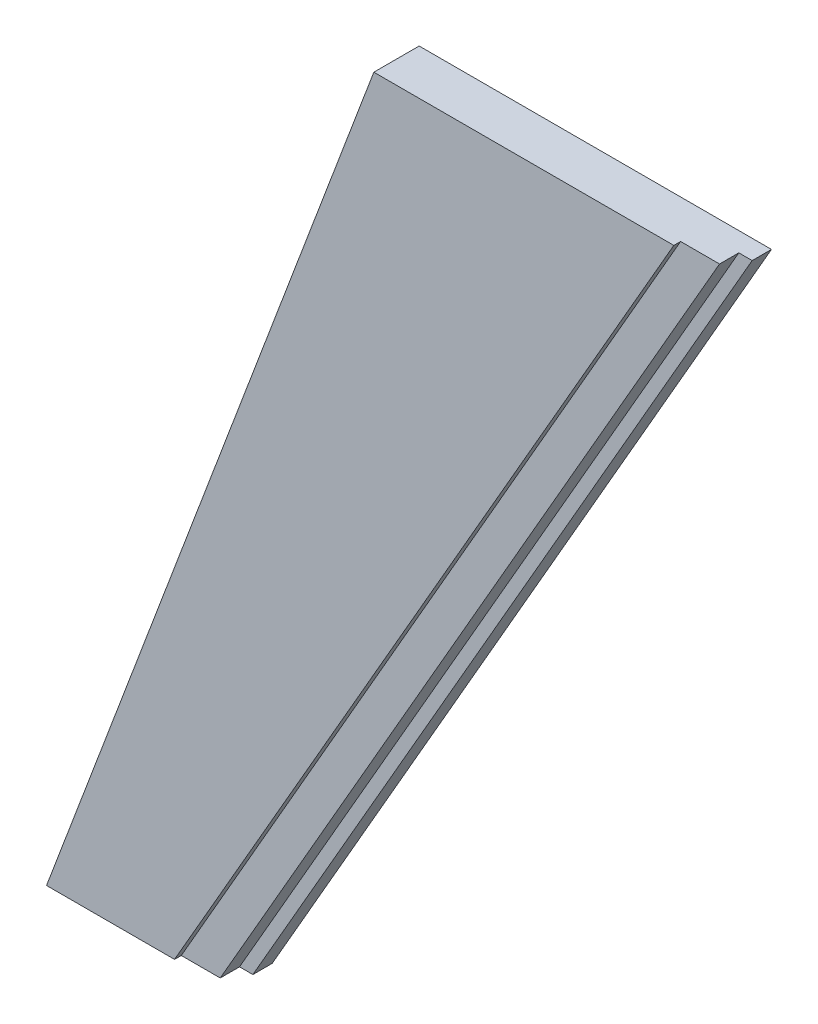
ISO-10303-21;
HEADER;
FILE_DESCRIPTION(('STEP AP214'),'2;1');
FILE_NAME('part.step','',(''),(''),'','','');
FILE_SCHEMA(('AUTOMOTIVE_DESIGN { 1 0 10303 214 1 1 1 1 }'));
ENDSEC;
DATA;
#1=APPLICATION_CONTEXT('core data for automotive mechanical design processes');
#2=APPLICATION_PROTOCOL_DEFINITION('international standard','automotive_design',2000,#1);
#3=PRODUCT_CONTEXT('',#1,'mechanical');
#4=PRODUCT('Part','Part','',(#3));
#5=PRODUCT_RELATED_PRODUCT_CATEGORY('part','',(#4));
#6=PRODUCT_DEFINITION_FORMATION('','',#4);
#7=PRODUCT_DEFINITION_CONTEXT('part definition',#1,'design');
#8=PRODUCT_DEFINITION('design','',#6,#7);
#9=PRODUCT_DEFINITION_SHAPE('','',#8);
#10=(LENGTH_UNIT() NAMED_UNIT(*) SI_UNIT(.MILLI.,.METRE.));
#11=(NAMED_UNIT(*) PLANE_ANGLE_UNIT() SI_UNIT($,.RADIAN.));
#12=(NAMED_UNIT(*) SI_UNIT($,.STERADIAN.) SOLID_ANGLE_UNIT());
#13=UNCERTAINTY_MEASURE_WITH_UNIT(LENGTH_MEASURE(1.E-05),#10,'distance_accuracy_value','');
#14=(GEOMETRIC_REPRESENTATION_CONTEXT(3) GLOBAL_UNCERTAINTY_ASSIGNED_CONTEXT((#13)) GLOBAL_UNIT_ASSIGNED_CONTEXT((#10,
#11,#12)) REPRESENTATION_CONTEXT('',''));
#15=CARTESIAN_POINT('',(0.,0.,0.));
#16=DIRECTION('',(0.,0.,1.));
#17=DIRECTION('',(1.,0.,0.));
#18=AXIS2_PLACEMENT_3D('',#15,#16,#17);
#19=CARTESIAN_POINT('',(-620.780305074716,0.,47.));
#20=DIRECTION('',(-0.866820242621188,0.498620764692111,0.));
#21=DIRECTION('',(-0.498620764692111,-0.866820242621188,0.));
#22=AXIS2_PLACEMENT_3D('',#19,#20,#21);
#23=PLANE('',#22);
#24=DIRECTION('',(0.,0.,-1.));
#25=VECTOR('',#24,1.);
#26=CARTESIAN_POINT('',(-1138.48705228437,-900.000000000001,47.));
#27=LINE('',#26,#25);
#28=CARTESIAN_POINT('',(-1138.48705228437,-900.000000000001,47.));
#29=VERTEX_POINT('',#28);
#30=CARTESIAN_POINT('',(-1138.48705228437,-900.000000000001,40.));
#31=VERTEX_POINT('',#30);
#32=EDGE_CURVE('E49',#29,#31,#27,.T.);
#33=ORIENTED_EDGE('',*,*,#32,.T.);
#34=DIRECTION('',(0.498620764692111,0.866820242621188,0.));
#35=VECTOR('',#34,1.);
#36=CARTESIAN_POINT('',(-620.780305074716,0.,40.));
#37=LINE('',#36,#35);
#38=CARTESIAN_POINT('',(-620.780305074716,0.,40.));
#39=VERTEX_POINT('',#38);
#40=EDGE_CURVE('E45',#31,#39,#37,.T.);
#41=ORIENTED_EDGE('',*,*,#40,.T.);
#42=DIRECTION('',(0.,0.,-1.));
#43=VECTOR('',#42,1.);
#44=CARTESIAN_POINT('',(-620.780305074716,0.,47.));
#45=LINE('',#44,#43);
#46=CARTESIAN_POINT('',(-620.780305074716,0.,47.));
#47=VERTEX_POINT('',#46);
#48=EDGE_CURVE('E11',#47,#39,#45,.T.);
#49=ORIENTED_EDGE('',*,*,#48,.F.);
#50=DIRECTION('',(0.498620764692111,0.866820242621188,0.));
#51=VECTOR('',#50,1.);
#52=CARTESIAN_POINT('',(-620.780305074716,0.,47.));
#53=LINE('',#52,#51);
#54=EDGE_CURVE('E147',#29,#47,#53,.T.);
#55=ORIENTED_EDGE('',*,*,#54,.F.);
#56=EDGE_LOOP('',(#33,#41,#49,#55));
#57=FACE_BOUND('',#56,.T.);
#58=ADVANCED_FACE('F31',(#57),#23,.F.);
#59=CARTESIAN_POINT('',(-620.780305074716,0.,47.));
#60=DIRECTION('',(0.,-1.,0.));
#61=DIRECTION('',(1.,0.,0.));
#62=AXIS2_PLACEMENT_3D('',#59,#60,#61);
#63=PLANE('',#62);
#64=DIRECTION('',(-1.,0.,0.));
#65=VECTOR('',#64,1.);
#66=CARTESIAN_POINT('',(-620.780305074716,0.,0.));
#67=LINE('',#66,#65);
#68=CARTESIAN_POINT('',(-566.559143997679,0.,0.));
#69=VERTEX_POINT('',#68);
#70=CARTESIAN_POINT('',(-931.84683607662,-1.14114555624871E-13,0.));
#71=VERTEX_POINT('',#70);
#72=EDGE_CURVE('E94',#69,#71,#67,.T.);
#73=ORIENTED_EDGE('',*,*,#72,.T.);
#74=DIRECTION('',(0.,0.,-1.));
#75=VECTOR('',#74,1.);
#76=CARTESIAN_POINT('',(-931.84683607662,-1.14114555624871E-13,47.));
#77=LINE('',#76,#75);
#78=CARTESIAN_POINT('',(-931.84683607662,-1.14114555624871E-13,47.));
#79=VERTEX_POINT('',#78);
#80=EDGE_CURVE('E38',#79,#71,#77,.T.);
#81=ORIENTED_EDGE('',*,*,#80,.F.);
#82=DIRECTION('',(-1.,0.,0.));
#83=VECTOR('',#82,1.);
#84=CARTESIAN_POINT('',(-620.780305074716,0.,47.));
#85=LINE('',#84,#83);
#86=EDGE_CURVE('E150',#47,#79,#85,.T.);
#87=ORIENTED_EDGE('',*,*,#86,.F.);
#88=ORIENTED_EDGE('',*,*,#48,.T.);
#89=DIRECTION('',(1.,0.,0.));
#90=VECTOR('',#89,1.);
#91=CARTESIAN_POINT('',(-620.780305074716,0.,40.));
#92=LINE('',#91,#90);
#93=CARTESIAN_POINT('',(-580.402844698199,0.,40.));
#94=VERTEX_POINT('',#93);
#95=EDGE_CURVE('E131',#39,#94,#92,.T.);
#96=ORIENTED_EDGE('',*,*,#95,.T.);
#97=DIRECTION('',(0.,0.,-1.));
#98=VECTOR('',#97,1.);
#99=CARTESIAN_POINT('',(-580.402844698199,0.,40.));
#100=LINE('',#99,#98);
#101=CARTESIAN_POINT('',(-580.402844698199,0.,20.));
#102=VERTEX_POINT('',#101);
#103=EDGE_CURVE('E140',#94,#102,#100,.T.);
#104=ORIENTED_EDGE('',*,*,#103,.T.);
#105=DIRECTION('',(1.,0.,0.));
#106=VECTOR('',#105,1.);
#107=CARTESIAN_POINT('',(-580.402844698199,0.,20.));
#108=LINE('',#107,#106);
#109=CARTESIAN_POINT('',(-566.559143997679,0.,20.));
#110=VERTEX_POINT('',#109);
#111=EDGE_CURVE('E110',#102,#110,#108,.T.);
#112=ORIENTED_EDGE('',*,*,#111,.T.);
#113=DIRECTION('',(0.,0.,-1.));
#114=VECTOR('',#113,1.);
#115=CARTESIAN_POINT('',(-566.559143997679,0.,20.));
#116=LINE('',#115,#114);
#117=EDGE_CURVE('E107',#110,#69,#116,.T.);
#118=ORIENTED_EDGE('',*,*,#117,.T.);
#119=EDGE_LOOP('',(#73,#81,#87,#88,#96,#104,#112,#118));
#120=FACE_BOUND('',#119,.T.);
#121=ADVANCED_FACE('F108',(#120),#63,.F.);
#122=CARTESIAN_POINT('',(-931.84683607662,-1.14114555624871E-13,47.));
#123=DIRECTION('',(0.935690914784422,-0.352820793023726,0.));
#124=DIRECTION('',(0.352820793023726,0.935690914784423,0.));
#125=AXIS2_PLACEMENT_3D('',#122,#123,#124);
#126=PLANE('',#125);
#127=DIRECTION('',(-0.352820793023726,-0.935690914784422,0.));
#128=VECTOR('',#127,1.);
#129=CARTESIAN_POINT('',(-931.84683607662,-1.14114555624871E-13,0.));
#130=LINE('',#129,#128);
#131=CARTESIAN_POINT('',(-1271.20966273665,-900.,0.));
#132=VERTEX_POINT('',#131);
#133=EDGE_CURVE('E100',#71,#132,#130,.T.);
#134=ORIENTED_EDGE('',*,*,#133,.T.);
#135=DIRECTION('',(0.,0.,-1.));
#136=VECTOR('',#135,1.);
#137=CARTESIAN_POINT('',(-1271.20966273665,-900.,47.));
#138=LINE('',#137,#136);
#139=CARTESIAN_POINT('',(-1271.20966273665,-900.,47.));
#140=VERTEX_POINT('',#139);
#141=EDGE_CURVE('E157',#140,#132,#138,.T.);
#142=ORIENTED_EDGE('',*,*,#141,.F.);
#143=DIRECTION('',(-0.352820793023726,-0.935690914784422,0.));
#144=VECTOR('',#143,1.);
#145=CARTESIAN_POINT('',(-931.84683607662,-1.14114555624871E-13,47.));
#146=LINE('',#145,#144);
#147=EDGE_CURVE('E152',#79,#140,#146,.T.);
#148=ORIENTED_EDGE('',*,*,#147,.F.);
#149=ORIENTED_EDGE('',*,*,#80,.T.);
#150=EDGE_LOOP('',(#134,#142,#148,#149));
#151=FACE_BOUND('',#150,.T.);
#152=ADVANCED_FACE('F161',(#151),#126,.F.);
#153=CARTESIAN_POINT('',(-1271.20966273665,-900.,47.));
#154=DIRECTION('',(0.,1.,0.));
#155=DIRECTION('',(-1.,0.,0.));
#156=AXIS2_PLACEMENT_3D('',#153,#154,#155);
#157=PLANE('',#156);
#158=DIRECTION('',(1.,0.,0.));
#159=VECTOR('',#158,1.);
#160=CARTESIAN_POINT('',(-1271.20966273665,-900.,0.));
#161=LINE('',#160,#159);
#162=CARTESIAN_POINT('',(-1084.26589120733,-900.000000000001,0.));
#163=VERTEX_POINT('',#162);
#164=EDGE_CURVE('E145',#132,#163,#161,.T.);
#165=ORIENTED_EDGE('',*,*,#164,.T.);
#166=DIRECTION('',(0.,0.,-1.));
#167=VECTOR('',#166,1.);
#168=CARTESIAN_POINT('',(-1084.26589120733,-900.000000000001,20.));
#169=LINE('',#168,#167);
#170=CARTESIAN_POINT('',(-1084.26589120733,-900.000000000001,20.));
#171=VERTEX_POINT('',#170);
#172=EDGE_CURVE('E114',#171,#163,#169,.T.);
#173=ORIENTED_EDGE('',*,*,#172,.F.);
#174=DIRECTION('',(-1.,0.,0.));
#175=VECTOR('',#174,1.);
#176=CARTESIAN_POINT('',(-1098.10959190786,-900.000000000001,20.));
#177=LINE('',#176,#175);
#178=CARTESIAN_POINT('',(-1098.10959190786,-900.000000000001,20.));
#179=VERTEX_POINT('',#178);
#180=EDGE_CURVE('E115',#171,#179,#177,.T.);
#181=ORIENTED_EDGE('',*,*,#180,.T.);
#182=DIRECTION('',(0.,0.,-1.));
#183=VECTOR('',#182,1.);
#184=CARTESIAN_POINT('',(-1098.10959190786,-900.000000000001,40.));
#185=LINE('',#184,#183);
#186=CARTESIAN_POINT('',(-1098.10959190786,-900.000000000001,40.));
#187=VERTEX_POINT('',#186);
#188=EDGE_CURVE('E104',#187,#179,#185,.T.);
#189=ORIENTED_EDGE('',*,*,#188,.F.);
#190=DIRECTION('',(-1.,0.,0.));
#191=VECTOR('',#190,1.);
#192=CARTESIAN_POINT('',(-1138.48705228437,-900.000000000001,40.));
#193=LINE('',#192,#191);
#194=EDGE_CURVE('E137',#187,#31,#193,.T.);
#195=ORIENTED_EDGE('',*,*,#194,.T.);
#196=ORIENTED_EDGE('',*,*,#32,.F.);
#197=DIRECTION('',(1.,0.,0.));
#198=VECTOR('',#197,1.);
#199=CARTESIAN_POINT('',(-1271.20966273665,-900.,47.));
#200=LINE('',#199,#198);
#201=EDGE_CURVE('E154',#140,#29,#200,.T.);
#202=ORIENTED_EDGE('',*,*,#201,.F.);
#203=ORIENTED_EDGE('',*,*,#141,.T.);
#204=EDGE_LOOP('',(#165,#173,#181,#189,#195,#196,#202,#203));
#205=FACE_BOUND('',#204,.T.);
#206=ADVANCED_FACE('F174',(#205),#157,.F.);
#207=CARTESIAN_POINT('',(-1138.48705228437,-900.000000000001,47.));
#208=DIRECTION('',(0.,0.,1.));
#209=DIRECTION('',(1.,0.,0.));
#210=AXIS2_PLACEMENT_3D('',#207,#208,#209);
#211=PLANE('',#210);
#212=ORIENTED_EDGE('',*,*,#54,.T.);
#213=ORIENTED_EDGE('',*,*,#86,.T.);
#214=ORIENTED_EDGE('',*,*,#147,.T.);
#215=ORIENTED_EDGE('',*,*,#201,.T.);
#216=EDGE_LOOP('',(#212,#213,#214,#215));
#217=FACE_BOUND('',#216,.T.);
#218=ADVANCED_FACE('F165',(#217),#211,.T.);
#219=CARTESIAN_POINT('',(-1138.48705228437,-900.000000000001,0.));
#220=DIRECTION('',(0.,0.,1.));
#221=DIRECTION('',(1.,0.,0.));
#222=AXIS2_PLACEMENT_3D('',#219,#220,#221);
#223=PLANE('',#222);
#224=ORIENTED_EDGE('',*,*,#72,.F.);
#225=DIRECTION('',(-0.498620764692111,-0.866820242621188,0.));
#226=VECTOR('',#225,1.);
#227=CARTESIAN_POINT('',(-1084.26589120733,-900.000000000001,0.));
#228=LINE('',#227,#226);
#229=EDGE_CURVE('E99',#69,#163,#228,.T.);
#230=ORIENTED_EDGE('',*,*,#229,.T.);
#231=ORIENTED_EDGE('',*,*,#164,.F.);
#232=ORIENTED_EDGE('',*,*,#133,.F.);
#233=EDGE_LOOP('',(#224,#230,#231,#232));
#234=FACE_BOUND('',#233,.T.);
#235=ADVANCED_FACE('F96',(#234),#223,.F.);
#236=CARTESIAN_POINT('',(-1098.10959190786,-900.000000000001,40.));
#237=DIRECTION('',(0.866820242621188,-0.49862076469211,0.));
#238=DIRECTION('',(0.498620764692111,0.866820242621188,0.));
#239=AXIS2_PLACEMENT_3D('',#236,#237,#238);
#240=PLANE('',#239);
#241=DIRECTION('',(0.49862076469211,0.866820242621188,0.));
#242=VECTOR('',#241,1.);
#243=CARTESIAN_POINT('',(-580.402844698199,0.,20.));
#244=LINE('',#243,#242);
#245=EDGE_CURVE('E119',#179,#102,#244,.T.);
#246=ORIENTED_EDGE('',*,*,#245,.T.);
#247=ORIENTED_EDGE('',*,*,#103,.F.);
#248=DIRECTION('',(-0.49862076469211,-0.866820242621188,0.));
#249=VECTOR('',#248,1.);
#250=CARTESIAN_POINT('',(-1098.10959190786,-900.000000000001,40.));
#251=LINE('',#250,#249);
#252=EDGE_CURVE('E134',#94,#187,#251,.T.);
#253=ORIENTED_EDGE('',*,*,#252,.T.);
#254=ORIENTED_EDGE('',*,*,#188,.T.);
#255=EDGE_LOOP('',(#246,#247,#253,#254));
#256=FACE_BOUND('',#255,.T.);
#257=ADVANCED_FACE('F184',(#256),#240,.T.);
#258=CARTESIAN_POINT('',(-1138.48705228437,-900.000000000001,40.));
#259=DIRECTION('',(0.,0.,1.));
#260=DIRECTION('',(1.,0.,0.));
#261=AXIS2_PLACEMENT_3D('',#258,#259,#260);
#262=PLANE('',#261);
#263=ORIENTED_EDGE('',*,*,#40,.F.);
#264=ORIENTED_EDGE('',*,*,#194,.F.);
#265=ORIENTED_EDGE('',*,*,#252,.F.);
#266=ORIENTED_EDGE('',*,*,#95,.F.);
#267=EDGE_LOOP('',(#263,#264,#265,#266));
#268=FACE_BOUND('',#267,.T.);
#269=ADVANCED_FACE('F187',(#268),#262,.T.);
#270=CARTESIAN_POINT('',(-1084.26589120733,-900.000000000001,20.));
#271=DIRECTION('',(0.866820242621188,-0.498620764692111,0.));
#272=DIRECTION('',(0.498620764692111,0.866820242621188,0.));
#273=AXIS2_PLACEMENT_3D('',#270,#271,#272);
#274=PLANE('',#273);
#275=ORIENTED_EDGE('',*,*,#229,.F.);
#276=ORIENTED_EDGE('',*,*,#117,.F.);
#277=DIRECTION('',(-0.498620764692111,-0.866820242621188,0.));
#278=VECTOR('',#277,1.);
#279=CARTESIAN_POINT('',(-1084.26589120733,-900.000000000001,20.));
#280=LINE('',#279,#278);
#281=EDGE_CURVE('E125',#110,#171,#280,.T.);
#282=ORIENTED_EDGE('',*,*,#281,.T.);
#283=ORIENTED_EDGE('',*,*,#172,.T.);
#284=EDGE_LOOP('',(#275,#276,#282,#283));
#285=FACE_BOUND('',#284,.T.);
#286=ADVANCED_FACE('F118',(#285),#274,.T.);
#287=CARTESIAN_POINT('',(-1098.10959190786,-900.000000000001,20.));
#288=DIRECTION('',(0.,0.,1.));
#289=DIRECTION('',(1.,0.,0.));
#290=AXIS2_PLACEMENT_3D('',#287,#288,#289);
#291=PLANE('',#290);
#292=ORIENTED_EDGE('',*,*,#245,.F.);
#293=ORIENTED_EDGE('',*,*,#180,.F.);
#294=ORIENTED_EDGE('',*,*,#281,.F.);
#295=ORIENTED_EDGE('',*,*,#111,.F.);
#296=EDGE_LOOP('',(#292,#293,#294,#295));
#297=FACE_BOUND('',#296,.T.);
#298=ADVANCED_FACE('F194',(#297),#291,.T.);
#299=CLOSED_SHELL('',(#58,#121,#152,#206,#218,#235,#257,#269,#286,#298));
#300=MANIFOLD_SOLID_BREP('B2',#299);
#301=ADVANCED_BREP_SHAPE_REPRESENTATION('',(#18,#300),#14);
#302=SHAPE_DEFINITION_REPRESENTATION(#9,#301);
ENDSEC;
END-ISO-10303-21;
